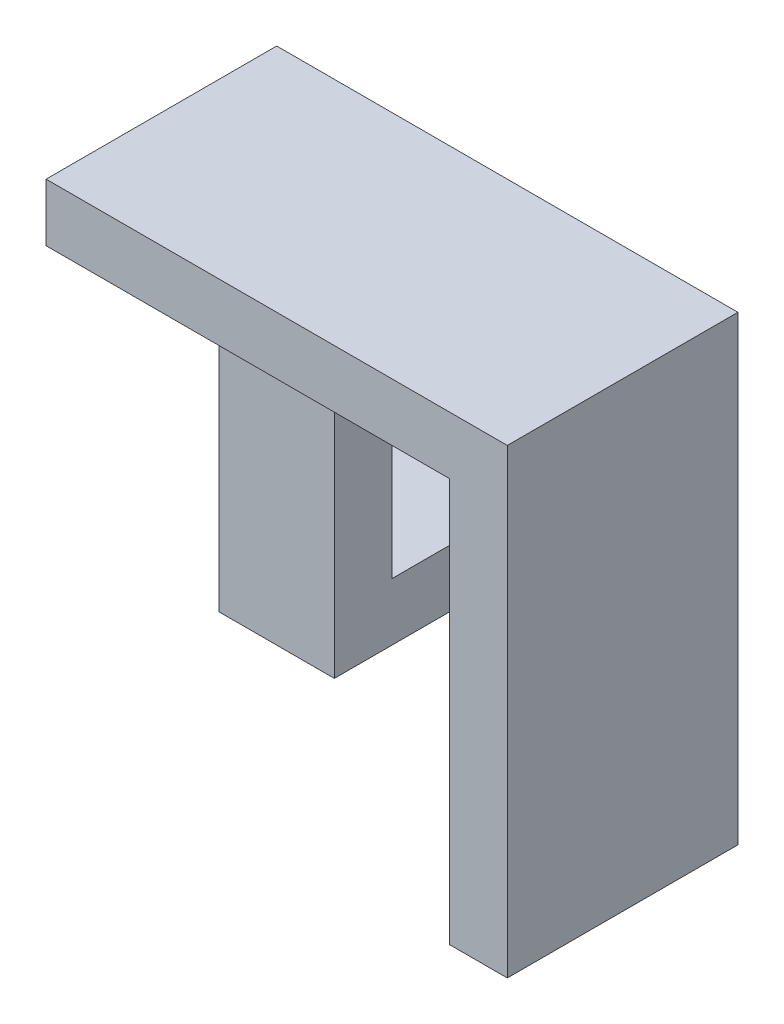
from build123d import *

# Parameters (mm, degrees)
CROQUIS1_W                  = 80
CROQUIS1_H                  = 80
SALIENTE_EXTRUIR1_DEPTH     = 35
CORTAR_EXTRUIR13_DEPTH      = 67.520673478
CORTAR_EXTRUIR13_DEPTH_BACK = 67.520673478
CROQUIS15_W                 = 50
CROQUIS15_H                 = 70
CROQUIS16_W                 = 30
CROQUIS16_H                 = 70
CORTAR_EXTRUIR14_DEPTH      = 70
CROQUIS17_W                 = 30
CROQUIS17_H                 = 70
CORTAR_EXTRUIR15_DEPTH      = 97.046863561
CROQUIS18_W                 = 10
CROQUIS18_H                 = 30
CORTAR_EXTRUIR16_DEPTH      = 88.891979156


with BuildPart() as part:
    # Croquis1 → Saliente-Extruir1 (new, symmetric)
    with BuildSketch(Plane.XY):
        Rectangle(CROQUIS1_W, CROQUIS1_H)
    extrude(amount=SALIENTE_EXTRUIR1_DEPTH, both=True)

    # Croquis15 → Cortar-Extruir13 (cut, two sides: drawn at the far end of the back side and taken through both)
    with BuildSketch(Plane.XY.offset(-CORTAR_EXTRUIR13_DEPTH_BACK)):
        with Locations((5, -5)):
            Rectangle(CROQUIS15_W, CROQUIS15_H)
    extrude(amount=CORTAR_EXTRUIR13_DEPTH + CORTAR_EXTRUIR13_DEPTH_BACK, mode=Mode.SUBTRACT)

    # Croquis16 → Cortar-Extruir14 (cut)
    with BuildSketch(Plane.ZY.offset(40)):
        with Locations((20, -5)):
            Rectangle(CROQUIS16_W, CROQUIS16_H)
    extrude(amount=-CORTAR_EXTRUIR14_DEPTH, mode=Mode.SUBTRACT)

    # Croquis17 → Cortar-Extruir15 (cut, through all)
    with BuildSketch(Plane.ZY.offset(40)):
        with Locations((-20, 5)):
            Rectangle(CROQUIS17_W, CROQUIS17_H)
    extrude(amount=-CORTAR_EXTRUIR15_DEPTH, mode=Mode.SUBTRACT)

    # Croquis18 → Cortar-Extruir16 (cut, through all)
    with BuildSketch(Plane(origin=(0, -30, 0), x_dir=(1, 0, 0), z_dir=(0, 1, 0))):
        with Locations((35, 20)):
            Rectangle(CROQUIS18_W, CROQUIS18_H)
    extrude(amount=-CORTAR_EXTRUIR16_DEPTH, mode=Mode.SUBTRACT)


solid = part.part
